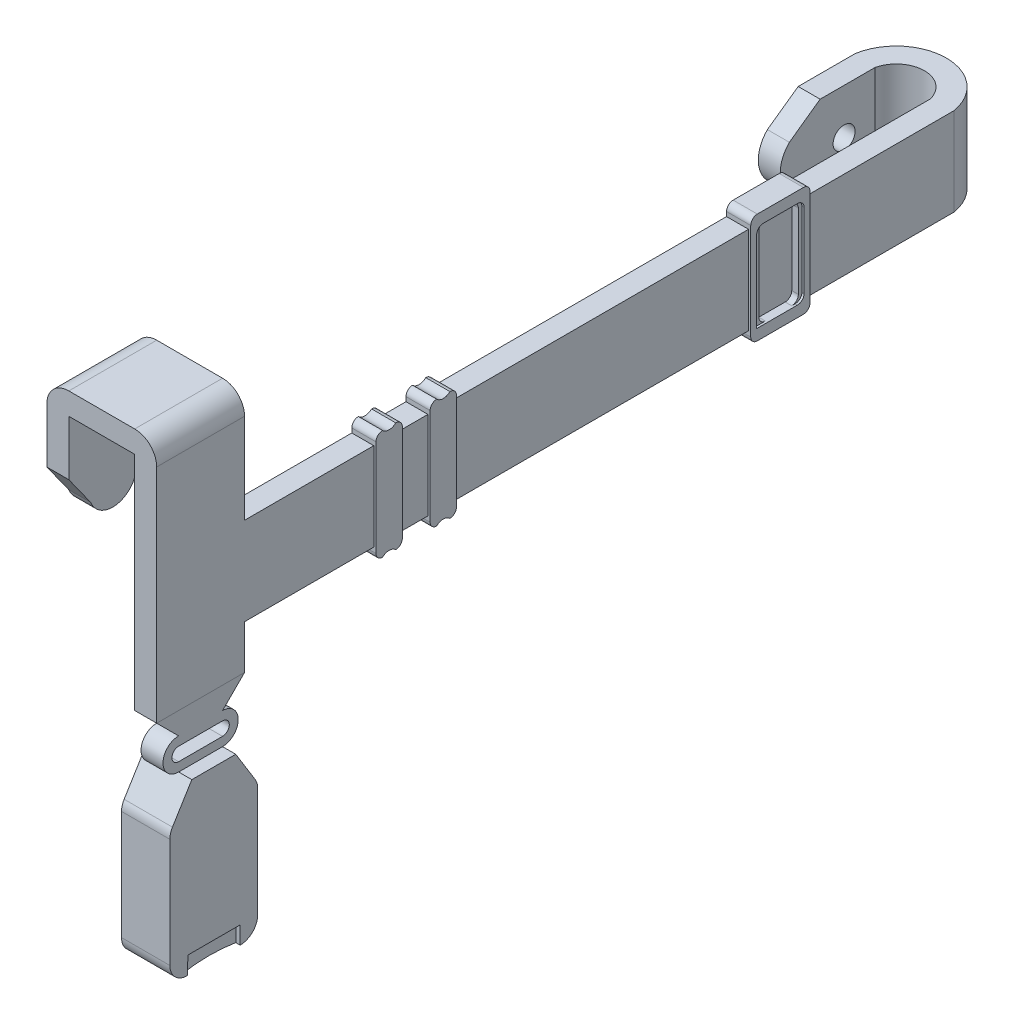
from build123d import *

# Parameters (mm, degrees)
EXTRUIR_L_MINA3_DEPTH         = 40
CROQUIS4_W                    = 10
CROQUIS4_H                    = 40
SALIENTE_EXTRUIR1_DEPTH       = 20
SALIENTE_EXTRUIR4_DEPTH       = 1
SALIENTE_EXTRUIR4_DEPTH_BACK  = 10
CORTAR_EXTRUIR1_DEPTH         = 3
SALIENTE_EXTRUIR6_DEPTH       = 10
CROQUIS16_W                   = 10
CROQUIS16_H                   = 40
SALIENTE_EXTRUIR10_DEPTH      = 41
CROQUIS19_R                   = 5
CORTAR_EXTRUIR4_DEPTH         = 10
SALIENTE_EXTRUIR11_DEPTH      = 10
SALIENTE_EXTRUIR12_DEPTH      = 10
REDONDEO4_R                   = 10
CROQUIS24_W                   = 10
CROQUIS24_H                   = 40
SALIENTE_EXTRUIR13_DEPTH      = 25
REDONDEO5_R                   = 10
SALIENTE_EXTRUIR14_DEPTH      = 10
SALIENTE_EXTRUIR15_DEPTH      = 6
SALIENTE_EXTRUIR15_DEPTH_BACK = 16
CORTAR_EXTRUIR5_DEPTH         = 386.612564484
CORTAR_EXTRUIR5_DEPTH_BACK    = 2


with BuildPart() as part:
    # Croquis1 → Extruir-L_mina3 (new body)
    with BuildSketch(Plane(origin=(0, 0, 0), x_dir=(1, 0, 0), z_dir=(0, 1, 0))):
        with BuildLine():
            Line((0, -362), (0, 0))
            ThreePointArc((0, 0), (-12.5, 9.959156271), (-25, 0))
            Line((-25, 0), (-25, -25))
            Line((-25, -25), (-35, -25))
            Line((-35, -25), (-35, 0.967839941))
            ThreePointArc((-35, 0.967839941), (-12.5, 19.959156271), (10, 0.967839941))
            Line((10, 0.967839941), (10, -362))
            Line((10, -362), (0, -362))
        make_face()
    extrude(amount=EXTRUIR_L_MINA3_DEPTH)

    # Croquis4 → Saliente-Extruir1 (add)
    with BuildSketch(Plane.XZ):
        with Locations((5, 342)):
            Rectangle(CROQUIS4_W, CROQUIS4_H)
    extrude(amount=SALIENTE_EXTRUIR1_DEPTH)

    # Croquis9 → Saliente-Extruir4 (add, two sides: drawn at the far end of the back side and taken through both)
    # profile 1 of 3: a face of its own
    with BuildSketch(Plane(origin=(10, 0, 0), x_dir=(0, 0, -1), z_dir=(1, 0, 0)).offset(-SALIENTE_EXTRUIR4_DEPTH_BACK)):
        with BuildLine():
            Line((-68.613513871, 45), (-89.587003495, 45))
            ThreePointArc((-89.587003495, 45), (-91.708323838, 44.121320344), (-92.587003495, 42))
            Line((-92.587003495, 42), (-92.587003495, -2))
            ThreePointArc((-92.587003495, -2), (-91.708323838, -4.121320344), (-89.587003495, -5))
            Line((-89.587003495, -5), (-68.613513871, -5))
            ThreePointArc((-68.613513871, -5), (-66.492193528, -4.121320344), (-65.613513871, -2))
            Line((-65.613513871, -2), (-65.613513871, 42))
            ThreePointArc((-65.613513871, 42), (-66.492193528, 44.121320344), (-68.613513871, 45))
        make_face()
        with BuildLine():
            Line((-71.310862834, 40), (-86.889654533, 40))
            ThreePointArc((-86.889654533, 40), (-89.010974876, 39.121320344), (-89.889654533, 37))
            Line((-89.889654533, 37), (-89.889654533, 0))
            Line((-89.889654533, 0), (-71.310862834, 0))
            ThreePointArc((-71.310862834, 0), (-69.18954249, 0.878679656), (-68.310862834, 3))
            Line((-68.310862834, 3), (-68.310862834, 37))
            ThreePointArc((-68.310862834, 37), (-69.18954249, 39.121320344), (-71.310862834, 40))
        make_face(mode=Mode.SUBTRACT)
    # profile 2 of 3: a face of its own
    with BuildSketch(Plane(origin=(10, 0, 0), x_dir=(0, 0, -1), z_dir=(1, 0, 0)).offset(-SALIENTE_EXTRUIR4_DEPTH_BACK)):
        with BuildLine():
            Line((-238.526073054, 42), (-238.526073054, -2))
            ThreePointArc((-238.526073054, -2), (-237.647393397, -4.121320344), (-235.526073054, -5))
            ThreePointArc((-235.526073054, -5), (-232.526073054, -3.757359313), (-229.526073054, -5))
            ThreePointArc((-229.526073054, -5), (-227.40475271, -4.121320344), (-226.526073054, -2))
            Line((-226.526073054, -2), (-226.526073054, 42))
            ThreePointArc((-226.526073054, 42), (-227.40475271, 44.121320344), (-229.526073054, 45))
            ThreePointArc((-229.526073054, 45), (-232.526073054, 43.757359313), (-235.526073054, 45))
            ThreePointArc((-235.526073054, 45), (-237.647393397, 44.121320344), (-238.526073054, 42))
        make_face()
    # profile 3 of 3: a face of its own
    with BuildSketch(Plane(origin=(10, 0, 0), x_dir=(0, 0, -1), z_dir=(1, 0, 0)).offset(-SALIENTE_EXTRUIR4_DEPTH_BACK)):
        with BuildLine():
            Line((-251.180473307, 42), (-251.180473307, -2))
            ThreePointArc((-251.180473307, -2), (-252.059152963, -4.121320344), (-254.180473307, -5))
            ThreePointArc((-254.180473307, -5), (-257.180473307, -3.757359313), (-260.180473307, -5))
            ThreePointArc((-260.180473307, -5), (-262.30179365, -4.121320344), (-263.180473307, -2))
            Line((-263.180473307, -2), (-263.180473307, 42))
            ThreePointArc((-263.180473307, 42), (-262.30179365, 44.121320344), (-260.180473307, 45))
            ThreePointArc((-260.180473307, 45), (-257.180473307, 43.757359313), (-254.180473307, 45))
            ThreePointArc((-254.180473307, 45), (-252.059152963, 44.121320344), (-251.180473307, 42))
        make_face()
    extrude(amount=SALIENTE_EXTRUIR4_DEPTH + SALIENTE_EXTRUIR4_DEPTH_BACK)

    # Croquis10 → Cortar-Extruir1 (cut)
    with BuildSketch(Plane(origin=(10, 0, 0), x_dir=(0, 0, -1), z_dir=(1, 0, 0))):
        with BuildLine():
            Line((-72.919704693, 40), (-84.919704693, 40))
            ThreePointArc((-84.919704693, 40), (-87.041025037, 39.121320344), (-87.919704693, 37))
            Line((-87.919704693, 37), (-87.919704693, 3))
            ThreePointArc((-87.919704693, 3), (-87.041025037, 0.878679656), (-84.919704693, 0))
            Line((-84.919704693, 0), (-72.919704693, 0))
            ThreePointArc((-72.919704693, 0), (-70.79838435, 0.878679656), (-69.919704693, 3))
            Line((-69.919704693, 3), (-69.919704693, 37))
            ThreePointArc((-69.919704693, 37), (-70.79838435, 39.121320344), (-72.919704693, 40))
        make_face()
    extrude(amount=-CORTAR_EXTRUIR1_DEPTH, mode=Mode.SUBTRACT)

    # Croquis16 → Saliente-Extruir10 (add)
    with BuildSketch(Plane(origin=(0, 40, 0), x_dir=(1, 0, 0), z_dir=(0, 1, 0))):
        with Locations((5, -342)):
            Rectangle(CROQUIS16_W, CROQUIS16_H)
    extrude(amount=SALIENTE_EXTRUIR10_DEPTH)

    # Croquis19 → Cortar-Extruir4 (cut)
    with BuildSketch(Plane.ZY.offset(35)):
        with Locations((14.095479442, 19.403681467)):
            Circle(CROQUIS19_R)
    extrude(amount=-CORTAR_EXTRUIR4_DEPTH, mode=Mode.SUBTRACT)

    # Croquis20 → Saliente-Extruir11 (add)
    with BuildSketch(Plane.ZY.offset(35)):
        with BuildLine():
            Line((39, 30), (25, 40))
            Line((25, 40), (25, 0))
            Line((25, 0), (39, 10))
            ThreePointArc((39, 10), (43.142135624, 20), (39, 30))
        make_face()
    extrude(amount=-SALIENTE_EXTRUIR11_DEPTH)

    # Croquis23 → Saliente-Extruir12 (add)
    with BuildSketch(Plane(origin=(0, 81, 0), x_dir=(1, 0, 0), z_dir=(0, 1, 0))):
        Polygon((0, -322), (-39.97908148, -322), (-39.97908148, -362), (0, -362), (10, -362), (10, -322), align=None)
    extrude(amount=SALIENTE_EXTRUIR12_DEPTH)

    # Redondeo4
    redondeo4_edges = [part.edges().sort_by_distance(p)[0] for p in [
        (10, 91, 342),
    ]]
    fillet(redondeo4_edges, radius=REDONDEO4_R)

    # Croquis24 → Saliente-Extruir13 (add)
    with BuildSketch(Plane.XZ.offset(-81)):
        with Locations((-34.97908148, 342)):
            Rectangle(CROQUIS24_W, CROQUIS24_H)
    extrude(amount=SALIENTE_EXTRUIR13_DEPTH)

    # Redondeo5
    redondeo5_edges = [part.edges().sort_by_distance(p)[0] for p in [
        (-39.97908148, 91, 342),
    ]]
    fillet(redondeo5_edges, radius=REDONDEO5_R)

    # Croquis25 → Saliente-Extruir14 (add)
    with BuildSketch(Plane.ZY.offset(39.97908148)):
        with BuildLine():
            Line((322, 56), (362, 56))
            Line((362, 56), (352, 42))
            ThreePointArc((352, 42), (342, 35.197757), (332, 42))
            Line((332, 42), (322, 56))
        make_face()
    extrude(amount=-SALIENTE_EXTRUIR14_DEPTH)


with BuildPart() as body_2:
    # Croquis7 → Saliente-Extruir6 (new body)
    # profile 1 of 2: a face of its own
    with BuildSketch(Plane(origin=(10, 0, 0), x_dir=(0, 0, -1), z_dir=(1, 0, 0))):
        Polygon((-362, -20), (-351.99915526, -29.999999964), (-341.99915526, -29.999999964), (-331.99915526, -29.999999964), (-322, -20), align=None)
    # profile 2 of 2: a face of its own
    with BuildSketch(Plane(origin=(10, 0, 0), x_dir=(0, 0, -1), z_dir=(1, 0, 0))):
        with BuildLine():
            ThreePointArc((-331.99915526, -29.999999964), (-324.878310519, -37.120844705), (-331.99915526, -44.241689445))
            Line((-331.99915526, -44.241689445), (-351.999155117, -44.241689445))
            ThreePointArc((-351.999155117, -44.241689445), (-359.12, -37.120844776), (-351.99915526, -29.999999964))
            Line((-351.99915526, -29.999999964), (-341.99915526, -29.999999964))
            Line((-341.99915526, -29.999999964), (-331.99915526, -29.999999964))
        make_face()
        with BuildLine():
            ThreePointArc((-331.99915526, -40.171794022), (-328.948205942, -37.120844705), (-331.99915526, -34.069895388))
            Line((-331.99915526, -34.069895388), (-351.99915526, -34.069895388))
            ThreePointArc((-351.99915526, -34.069895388), (-355.050104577, -37.120844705), (-351.99915526, -40.171794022))
            Line((-351.99915526, -40.171794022), (-331.99915526, -40.171794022))
        make_face(mode=Mode.SUBTRACT)
    extrude(amount=-SALIENTE_EXTRUIR6_DEPTH)

    # Croquis27 → Saliente-Extruir15 (add, two sides: drawn at the far end of the back side and taken through both)
    with BuildSketch(Plane(origin=(10, 0, 0), x_dir=(0, 0, -1), z_dir=(1, 0, 0)).offset(-SALIENTE_EXTRUIR15_DEPTH_BACK)):
        with BuildLine():
            ThreePointArc((-323.185341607, -58.568324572), (-322.301411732, -60.581971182), (-321.999155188, -62.760214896))
            Line((-321.999155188, -62.760214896), (-321.999155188, -112.496441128))
            ThreePointArc((-321.999155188, -112.496441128), (-324.342300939, -118.153295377), (-329.999155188, -120.496441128))
            Line((-329.999155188, -120.496441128), (-329.999155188, -112.496441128))
            Line((-329.999155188, -112.496441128), (-353.999155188, -112.496441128))
            Line((-353.999155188, -112.496441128), (-353.999155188, -120.496441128))
            ThreePointArc((-353.999155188, -120.496441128), (-359.656009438, -118.153295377), (-361.999155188, -112.496441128))
            Line((-361.999155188, -112.496441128), (-361.999155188, -62.760214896))
            ThreePointArc((-361.999155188, -62.760214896), (-361.696898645, -60.581971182), (-360.812968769, -58.568324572))
            Line((-360.812968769, -58.568324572), (-351.999155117, -44.241689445))
            Line((-351.999155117, -44.241689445), (-331.99915526, -44.241689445))
            Line((-331.99915526, -44.241689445), (-323.185341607, -58.568324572))
        make_face()
        with BuildLine():
            ThreePointArc((-329.999155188, -120.496441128), (-341.999155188, -119.535176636), (-353.999155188, -120.496441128))
            Line((-353.999155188, -120.496441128), (-353.999155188, -112.496441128))
            Line((-353.999155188, -112.496441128), (-329.999155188, -112.496441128))
            Line((-329.999155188, -112.496441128), (-329.999155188, -120.496441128))
        make_face()
    extrude(amount=SALIENTE_EXTRUIR15_DEPTH + SALIENTE_EXTRUIR15_DEPTH_BACK)

    # Croquis28 → Cortar-Extruir5 (cut, two sides: drawn at the far end of the back side and taken through both)
    with BuildSketch(Plane(origin=(16, 0, 0), x_dir=(0, 0, -1), z_dir=(1, 0, 0)).offset(-CORTAR_EXTRUIR5_DEPTH_BACK)):
        Polygon((-329.999155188, -989.741605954), (-329.999155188, -120.496441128), (-329.999155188, -112.496441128), (-353.783259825, -112.496441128), (-353.999155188, -120.496441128), (-377.44886765, -989.425245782), (-389.0395991, -2727.87693658), (-341.589886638, -2728.193296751), align=None)
    extrude(amount=CORTAR_EXTRUIR5_DEPTH + CORTAR_EXTRUIR5_DEPTH_BACK, mode=Mode.SUBTRACT)


solid = Compound([part.part, body_2.part])
